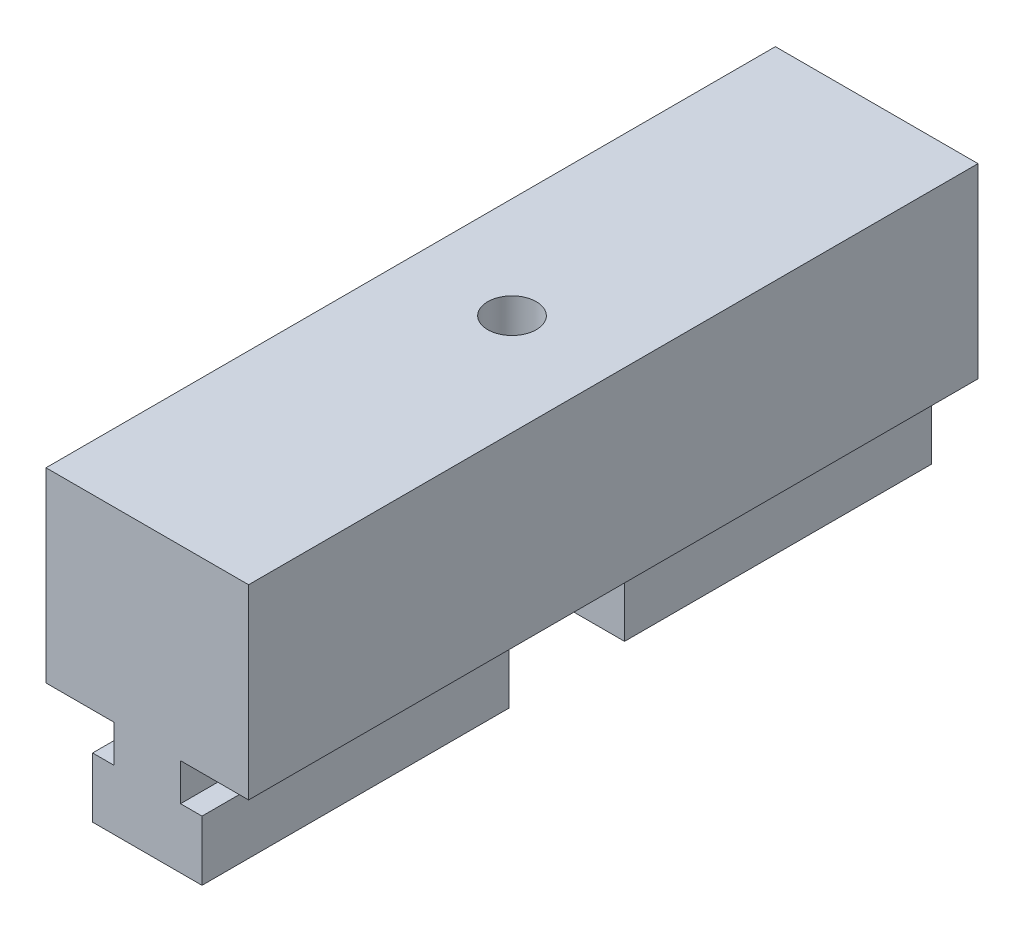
from build123d import *

# Parameters (mm, degrees)
EXTRUDE1_DEPTH      = 45
EXTRUDE1_DEPTH_BACK = 45
SKETCH2_W           = 13.5
SKETCH2_H           = 14.275
EXTRUDE2_DEPTH      = 7.62
SKETCH3_R           = 3
EXTRUDE3_DEPTH      = 55.137916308


with BuildPart() as part:
    # Sketch1 → Extrude1 (new, two sides: drawn at the far end of the back side and taken through both)
    with BuildSketch(Plane.XY.offset(-EXTRUDE1_DEPTH_BACK)):
        Polygon((-6.75, -4.599998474), (-6.75, -12), (6.75, -12), (6.75, -4.599998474), (4.100006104, -4.599998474), (4.100006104, 0), (12.5, 0), (12.5, 22.999992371), (-12.5, 22.999992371), (-12.5, 0), (-4.100006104, 0), (-4.100006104, -4.599998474), align=None)
    extrude(amount=EXTRUDE1_DEPTH + EXTRUDE1_DEPTH_BACK)

    # Sketch2 → Extrude2 (cut)
    with BuildSketch(Plane.XZ.offset(12)):
        Rectangle(SKETCH2_W, SKETCH2_H)
    extrude(amount=-EXTRUDE2_DEPTH, mode=Mode.SUBTRACT)

    # Sketch3 → Extrude3 (cut, through all)
    with BuildSketch(Plane.XZ.offset(4.38)):
        with Locations(Location((0, 0, 0), (0, 0, 270))):
            Circle(SKETCH3_R)
    extrude(amount=-EXTRUDE3_DEPTH, mode=Mode.SUBTRACT)


solid = part.part
